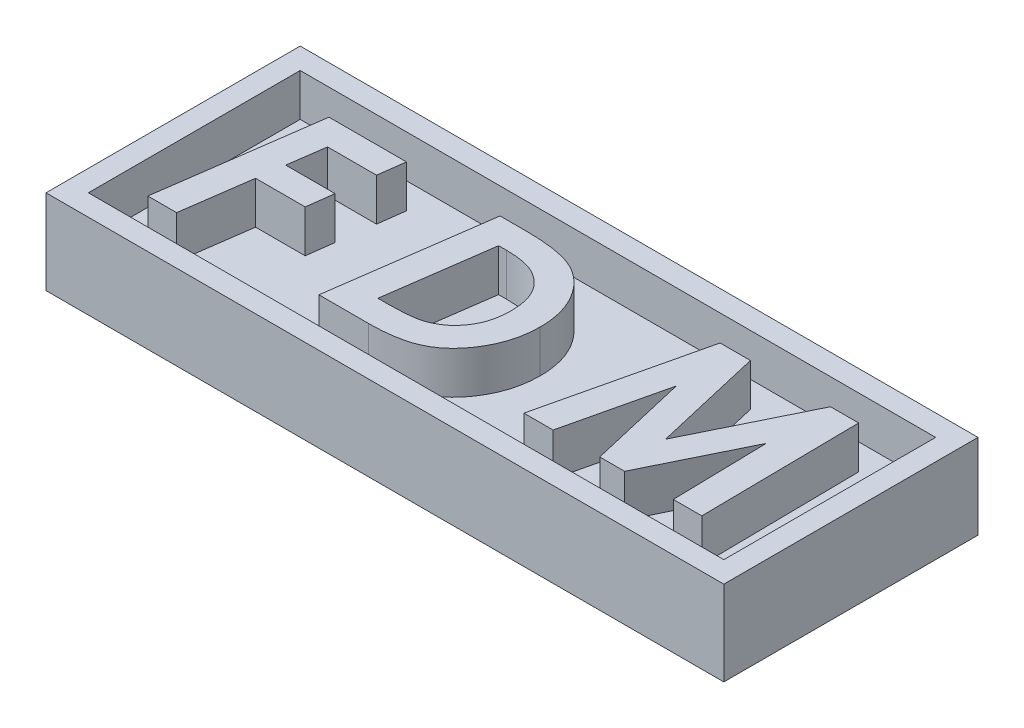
from build123d import *

# Parameters (mm, degrees)
SKETCH1_W           = 40.64
SKETCH1_H           = 15.24
BOSS_EXTRUDE1_DEPTH = 5.08
SKETCH2_W           = 38.1
SKETCH2_H           = 12.7
CUT_EXTRUDE1_DEPTH  = 2.54
BOSS_EXTRUDE2_DEPTH = 2.54
SKETCH5_W           = 2.177813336
SKETCH5_H           = 1.57861818
CUT_EXTRUDE2_DEPTH  = 5.08


with BuildPart() as part:
    # Sketch1 → Boss-Extrude1 (new body)
    with BuildSketch(Plane(origin=(0, 0, 0), x_dir=(1, 0, 0), z_dir=(0, 1, 0))):
        Rectangle(SKETCH1_W, SKETCH1_H)
    extrude(amount=BOSS_EXTRUDE1_DEPTH)

    # Sketch2 → Cut-Extrude1 (cut)
    with BuildSketch(Plane(origin=(0, 5.08, 0), x_dir=(1, 0, 0), z_dir=(0, 1, 0))):
        Rectangle(SKETCH2_W, SKETCH2_H)
    extrude(amount=-CUT_EXTRUDE1_DEPTH, mode=Mode.SUBTRACT)

    # Sketch4 → Boss-Extrude2 (add)
    # profile 1 of 3: a face of its own
    with BuildSketch(Plane(origin=(0, 2.54, 0), x_dir=(1, 0, 0), z_dir=(0, 1, 0))):
        Polygon((-15.764014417, 4.789902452), (-11.11599759, 4.789902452), (-11.323975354, 3.202402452), (-14.260468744, 3.202402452), (-14.569573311, 1.004325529), (-11.610183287, 1.004325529), (-11.818161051, -0.583174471), (-14.790907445, -0.583174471), (-15.374771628, -4.735097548), (-17.099651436, -4.735097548), align=None)
    # profile 2 of 3: a face of its own
    with BuildSketch(Plane(origin=(0, 2.54, 0), x_dir=(1, 0, 0), z_dir=(0, 1, 0))):
        with BuildLine():
            Line((-5.506322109, 4.789902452), (-4.002776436, 4.789902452))
            add(Edge.make_bspline(
                [(-4.002776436, 4.789902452), (-3.832299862, 4.788494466), (-3.502631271, 4.785771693), (-3.024553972, 4.763321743), (-2.580856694, 4.72369683), (-2.170727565, 4.668853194), (-1.794133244, 4.598882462), (-1.450929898, 4.514156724), (-1.140775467, 4.413923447), (-0.862805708, 4.293490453), (-0.606861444, 4.158347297), (-0.367006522, 4.004142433), (-0.139109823, 3.832801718), (0.078365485, 3.645409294), (0.281011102, 3.437849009), (0.471678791, 3.212308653), (0.651098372, 2.969277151), (0.818664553, 2.711277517), (0.969391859, 2.438491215), (1.101063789, 2.153375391), (1.214112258, 1.858634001), (1.303527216, 1.552649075), (1.374212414, 1.237155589), (1.425596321, 0.910923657), (1.456962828, 0.57436217), (1.460232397, 0.346751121), (1.461887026, 0.231564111)],
                knots=[0, 0, 0, 0, 1.508928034, 2.917973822, 4.235011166, 5.450779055, 6.579221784, 7.623755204, 8.577985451, 9.460610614, 10.301756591, 11.137250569, 11.981705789, 12.823774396, 13.675702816, 14.546470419, 15.435981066, 16.347923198, 17.267651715, 18.192054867, 19.125737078, 20.059147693, 21.011116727, 21.985721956, 22.980635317, 24, 24, 24, 24], degree=3))
            add(Edge.make_bspline(
                [(1.461887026, 0.231564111), (1.459562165, 0.112557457), (1.454941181, -0.123984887), (1.421783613, -0.474510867), (1.368161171, -0.817938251), (1.294248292, -1.154147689), (1.196902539, -1.483273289), (1.075355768, -1.803580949), (0.936958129, -2.118274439), (0.774323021, -2.420881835), (0.598931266, -2.711431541), (0.409038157, -2.983106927), (0.209871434, -3.235614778), (-0.003576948, -3.465490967), (-0.22720695, -3.676011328), (-0.461101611, -3.867171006), (-0.707784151, -4.03631834), (-0.966977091, -4.186458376), (-1.24558105, -4.318068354), (-1.547861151, -4.429560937), (-1.874746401, -4.525386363), (-2.227801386, -4.600194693), (-2.605341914, -4.661264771), (-3.008444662, -4.705005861), (-3.437063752, -4.72895142), (-3.7311681, -4.733008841), (-3.882569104, -4.735097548)],
                knots=[0, 0, 0, 0, 1.035326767, 2.057856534, 3.060426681, 4.057975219, 5.050723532, 6.043595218, 7.036960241, 8.039530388, 9.030318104, 9.988216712, 10.921569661, 11.826132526, 12.714780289, 13.59198308, 14.451536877, 15.31430869, 16.195534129, 17.128821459, 18.114698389, 19.15667332, 20.266554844, 21.441073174, 22.682698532, 24, 24, 24, 24], degree=3))
            Line((-3.882569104, -4.735097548), (-6.841959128, -4.735097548))
            Line((-6.841959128, -4.735097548), (-5.506322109, 4.789902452))
        make_face()
        with BuildLine():
            Line((-4.004684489, 3.202402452), (-4.893837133, -3.147597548))
            Line((-4.893837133, -3.147597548), (-4.277536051, -3.147597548))
            add(Edge.make_bspline(
                [(-4.277536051, -3.147597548), (-4.163036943, -3.147011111), (-3.942881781, -3.14588353), (-3.624860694, -3.133260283), (-3.331287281, -3.118232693), (-3.062313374, -3.090328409), (-2.816956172, -3.059278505), (-2.59688239, -3.018826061), (-2.399560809, -2.975345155), (-2.27950897, -2.934289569), (-2.222563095, -2.914815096)],
                knots=[0, 0, 0, 0, 1.323091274, 2.54399687, 3.677836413, 4.719289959, 5.668358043, 6.534823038, 7.305002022, 8, 8, 8, 8], degree=3))
            add(Edge.make_bspline(
                [(-2.222563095, -2.914815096), (-2.149394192, -2.886376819), (-2.004037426, -2.829881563), (-1.79904425, -2.719987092), (-1.600149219, -2.603511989), (-1.416049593, -2.466509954), (-1.240219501, -2.317790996), (-1.079693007, -2.151001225), (-0.926676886, -1.972275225), (-0.786594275, -1.77817059), (-0.658531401, -1.571800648), (-0.549473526, -1.351551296), (-0.455304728, -1.12034911), (-0.379899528, -0.876283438), (-0.320153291, -0.621281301), (-0.279335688, -0.354585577), (-0.250838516, -0.0762497), (-0.248777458, 0.113825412), (-0.247728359, 0.210575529)],
                knots=[0, 0, 0, 0, 0.952655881, 1.892538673, 2.821337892, 3.750040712, 4.676008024, 5.615700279, 6.558436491, 7.532008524, 8.520486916, 9.505184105, 10.513747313, 11.549809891, 12.604882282, 13.692134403, 14.825273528, 16, 16, 16, 16], degree=3))
            add(Edge.make_bspline(
                [(-0.247728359, 0.210575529), (-0.248824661, 0.290103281), (-0.250967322, 0.445535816), (-0.267803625, 0.673756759), (-0.299009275, 0.892120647), (-0.339851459, 1.100749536), (-0.394133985, 1.299461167), (-0.458818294, 1.488214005), (-0.534173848, 1.668374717), (-0.654774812, 1.890600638), (-0.826681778, 2.149868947), (-1.07780177, 2.423907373), (-1.36962376, 2.658009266), (-1.64163178, 2.821607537), (-1.879015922, 2.933549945), (-2.073971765, 3.005229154), (-2.282993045, 3.066760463), (-2.506441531, 3.114945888), (-2.743000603, 3.156345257), (-2.994287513, 3.181167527), (-3.259635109, 3.199553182), (-3.441772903, 3.201435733), (-3.535303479, 3.202402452)],
                knots=[0, 0, 0, 0, 0.941373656, 1.839862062, 2.706559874, 3.551131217, 4.354742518, 5.142827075, 5.911946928, 6.663057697, 8.133107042, 9.582556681, 11.0440985, 12.547036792, 13.328439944, 14.147940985, 15.003216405, 15.905576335, 16.852443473, 17.844335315, 18.893032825, 20, 20, 20, 20], degree=3))
            Line((-3.535303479, 3.202402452), (-4.004684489, 3.202402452))
        make_face(mode=Mode.SUBTRACT)
    # profile 3 of 3: a face of its own
    with BuildSketch(Plane(origin=(0, 2.54, 0), x_dir=(1, 0, 0), z_dir=(0, 1, 0))):
        Polygon((7.685955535, 4.789902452), (9.504329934, 4.789902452), (11.047944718, -1.84630548), (14.306899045, 4.789902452), (15.993617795, 4.789902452), (16.11573318, -4.735097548), (14.406117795, -4.735097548), (14.28400241, 0.962348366), (11.486796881, -4.735097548), (9.996607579, -4.735097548), (8.605637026, 1.248556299), (7.19940205, -4.735097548), (5.447809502, -4.735097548), align=None)
    extrude(amount=BOSS_EXTRUDE2_DEPTH)

    # Sketch5 → Cut-Extrude2 (cut)
    with BuildSketch(Plane(origin=(0, 2.54, 0), x_dir=(1, 0, 0), z_dir=(0, 1, 0))):
        with Locations((17.961093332, 5.56069091)):
            Rectangle(SKETCH5_W, SKETCH5_H)
    extrude(amount=-CUT_EXTRUDE2_DEPTH, mode=Mode.SUBTRACT)


solid = part.part
